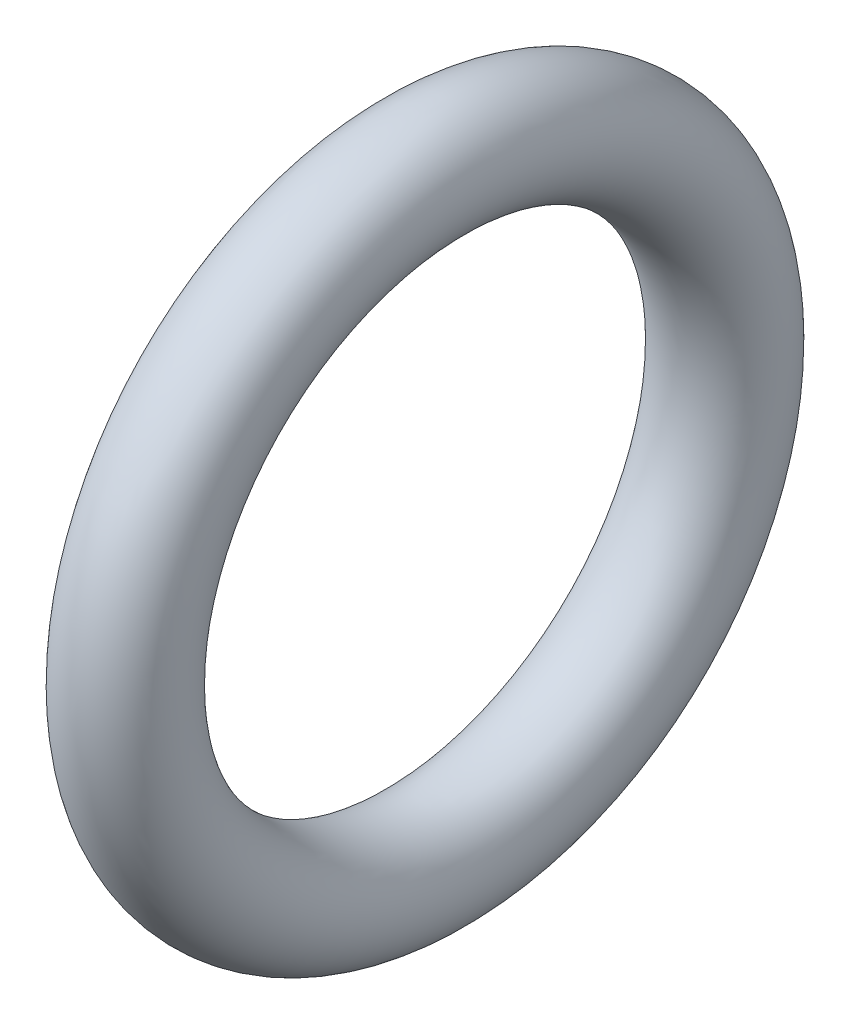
from build123d import *

# Parameters (mm, degrees)
SKETCH1_R = 0.254


with BuildPart() as part:
    # Sketch1 → Base-Revolve (revolve)
    with BuildSketch(Plane.XY, mode=Mode.PRIVATE) as base_revolve_sk:
        with Locations((0, 1.3589)):
            Circle(SKETCH1_R)
    revolve(base_revolve_sk.sketch.rotate(Axis((0, 0, 0), (1, 0, 0)), 90), axis=Axis((0, 0, 0), (1, 0, 0)))


solid = part.part
